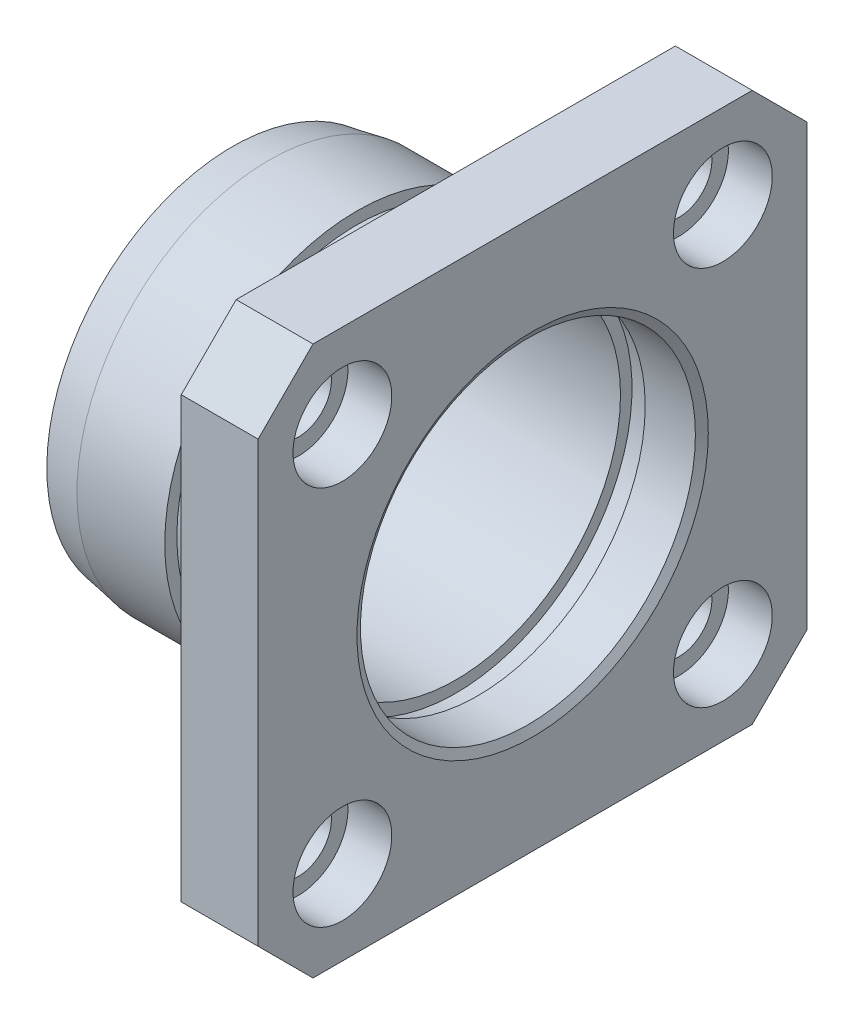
ISO-10303-21;
HEADER;
FILE_DESCRIPTION(('STEP AP214'),'2;1');
FILE_NAME('part.step','',(''),(''),'','','');
FILE_SCHEMA(('AUTOMOTIVE_DESIGN { 1 0 10303 214 1 1 1 1 }'));
ENDSEC;
DATA;
#1=APPLICATION_CONTEXT('core data for automotive mechanical design processes');
#2=APPLICATION_PROTOCOL_DEFINITION('international standard','automotive_design',2000,#1);
#3=PRODUCT_CONTEXT('',#1,'mechanical');
#4=PRODUCT('Part','Part','',(#3));
#5=PRODUCT_RELATED_PRODUCT_CATEGORY('part','',(#4));
#6=PRODUCT_DEFINITION_FORMATION('','',#4);
#7=PRODUCT_DEFINITION_CONTEXT('part definition',#1,'design');
#8=PRODUCT_DEFINITION('design','',#6,#7);
#9=PRODUCT_DEFINITION_SHAPE('','',#8);
#10=(LENGTH_UNIT() NAMED_UNIT(*) SI_UNIT(.MILLI.,.METRE.));
#11=(NAMED_UNIT(*) PLANE_ANGLE_UNIT() SI_UNIT($,.RADIAN.));
#12=(NAMED_UNIT(*) SI_UNIT($,.STERADIAN.) SOLID_ANGLE_UNIT());
#13=UNCERTAINTY_MEASURE_WITH_UNIT(LENGTH_MEASURE(1.E-05),#10,'distance_accuracy_value','');
#14=(GEOMETRIC_REPRESENTATION_CONTEXT(3) GLOBAL_UNCERTAINTY_ASSIGNED_CONTEXT((#13)) GLOBAL_UNIT_ASSIGNED_CONTEXT((#10,
#11,#12)) REPRESENTATION_CONTEXT('',''));
#15=CARTESIAN_POINT('',(0.,0.,0.));
#16=DIRECTION('',(0.,0.,1.));
#17=DIRECTION('',(1.,0.,0.));
#18=AXIS2_PLACEMENT_3D('',#15,#16,#17);
#19=CARTESIAN_POINT('',(56.,25.07,-32.));
#20=DIRECTION('',(1.,0.,0.));
#21=DIRECTION('',(0.,0.,-1.));
#22=AXIS2_PLACEMENT_3D('',#19,#20,#21);
#23=CYLINDRICAL_SURFACE('',#22,15.25);
#24=CARTESIAN_POINT('',(44.,25.07,-32.));
#25=DIRECTION('',(1.,0.,0.));
#26=DIRECTION('',(0.,0.,-1.));
#27=AXIS2_PLACEMENT_3D('',#24,#25,#26);
#28=CIRCLE('',#27,15.25);
#29=CARTESIAN_POINT('',(44.,25.07,-47.25));
#30=VERTEX_POINT('',#29);
#31=EDGE_CURVE('E186',#30,#30,#28,.T.);
#32=ORIENTED_EDGE('',*,*,#31,.F.);
#33=EDGE_LOOP('',(#32));
#34=FACE_BOUND('',#33,.T.);
#35=CARTESIAN_POINT('',(48.57,25.07,-32.));
#36=DIRECTION('',(1.,0.,0.));
#37=DIRECTION('',(0.,-0.707106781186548,-0.707106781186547));
#38=AXIS2_PLACEMENT_3D('',#35,#36,#37);
#39=CIRCLE('',#38,15.25);
#40=CARTESIAN_POINT('',(48.57,14.2866215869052,-42.7833784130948));
#41=VERTEX_POINT('',#40);
#42=EDGE_CURVE('E250',#41,#41,#39,.T.);
#43=ORIENTED_EDGE('',*,*,#42,.T.);
#44=EDGE_LOOP('',(#43));
#45=FACE_BOUND('',#44,.T.);
#46=ADVANCED_FACE('F17',(#34,#45),#23,.F.);
#47=CARTESIAN_POINT('',(45.,42.3941161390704,-14.6758838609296));
#48=DIRECTION('',(-1.,0.,0.));
#49=DIRECTION('',(0.,0.,1.));
#50=AXIS2_PLACEMENT_3D('',#47,#48,#49);
#51=CYLINDRICAL_SURFACE('',#50,4.5);
#52=CARTESIAN_POINT('',(45.,42.3941161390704,-14.6758838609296));
#53=DIRECTION('',(-1.,0.,0.));
#54=DIRECTION('',(0.,0.,1.));
#55=AXIS2_PLACEMENT_3D('',#52,#53,#54);
#56=CIRCLE('',#55,4.5);
#57=CARTESIAN_POINT('',(45.,42.3941161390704,-10.1758838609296));
#58=VERTEX_POINT('',#57);
#59=EDGE_CURVE('E21',#58,#58,#56,.T.);
#60=ORIENTED_EDGE('',*,*,#59,.T.);
#61=EDGE_LOOP('',(#60));
#62=FACE_BOUND('',#61,.T.);
#63=CARTESIAN_POINT('',(49.,42.3941161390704,-14.6758838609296));
#64=DIRECTION('',(-1.,0.,0.));
#65=DIRECTION('',(0.,0.,1.));
#66=AXIS2_PLACEMENT_3D('',#63,#64,#65);
#67=CIRCLE('',#66,4.5);
#68=CARTESIAN_POINT('',(49.,42.3941161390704,-10.1758838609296));
#69=VERTEX_POINT('',#68);
#70=EDGE_CURVE('E237',#69,#69,#67,.T.);
#71=ORIENTED_EDGE('',*,*,#70,.F.);
#72=EDGE_LOOP('',(#71));
#73=FACE_BOUND('',#72,.T.);
#74=ADVANCED_FACE('F342',(#62,#73),#51,.F.);
#75=CARTESIAN_POINT('',(45.,7.74588386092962,-14.6758838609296));
#76=DIRECTION('',(-1.,0.,0.));
#77=DIRECTION('',(0.,0.,1.));
#78=AXIS2_PLACEMENT_3D('',#75,#76,#77);
#79=CYLINDRICAL_SURFACE('',#78,4.5);
#80=CARTESIAN_POINT('',(45.,7.74588386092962,-14.6758838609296));
#81=DIRECTION('',(-1.,0.,0.));
#82=DIRECTION('',(0.,0.,1.));
#83=AXIS2_PLACEMENT_3D('',#80,#81,#82);
#84=CIRCLE('',#83,4.5);
#85=CARTESIAN_POINT('',(45.,7.74588386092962,-10.1758838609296));
#86=VERTEX_POINT('',#85);
#87=EDGE_CURVE('E245',#86,#86,#84,.T.);
#88=ORIENTED_EDGE('',*,*,#87,.T.);
#89=EDGE_LOOP('',(#88));
#90=FACE_BOUND('',#89,.T.);
#91=CARTESIAN_POINT('',(49.,7.74588386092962,-14.6758838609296));
#92=DIRECTION('',(-1.,0.,0.));
#93=DIRECTION('',(0.,0.,1.));
#94=AXIS2_PLACEMENT_3D('',#91,#92,#93);
#95=CIRCLE('',#94,4.5);
#96=CARTESIAN_POINT('',(49.,7.74588386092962,-10.1758838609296));
#97=VERTEX_POINT('',#96);
#98=EDGE_CURVE('E234',#97,#97,#95,.T.);
#99=ORIENTED_EDGE('',*,*,#98,.F.);
#100=EDGE_LOOP('',(#99));
#101=FACE_BOUND('',#100,.T.);
#102=ADVANCED_FACE('F347',(#90,#101),#79,.F.);
#103=CARTESIAN_POINT('',(45.,7.74588386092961,-49.3241161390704));
#104=DIRECTION('',(-1.,0.,0.));
#105=DIRECTION('',(0.,0.,1.));
#106=AXIS2_PLACEMENT_3D('',#103,#104,#105);
#107=CYLINDRICAL_SURFACE('',#106,4.5);
#108=CARTESIAN_POINT('',(45.,7.74588386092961,-49.3241161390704));
#109=DIRECTION('',(-1.,0.,0.));
#110=DIRECTION('',(0.,0.,1.));
#111=AXIS2_PLACEMENT_3D('',#108,#109,#110);
#112=CIRCLE('',#111,4.5);
#113=CARTESIAN_POINT('',(45.,7.74588386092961,-44.8241161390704));
#114=VERTEX_POINT('',#113);
#115=EDGE_CURVE('E243',#114,#114,#112,.T.);
#116=ORIENTED_EDGE('',*,*,#115,.T.);
#117=EDGE_LOOP('',(#116));
#118=FACE_BOUND('',#117,.T.);
#119=CARTESIAN_POINT('',(49.,7.74588386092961,-49.3241161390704));
#120=DIRECTION('',(-1.,0.,0.));
#121=DIRECTION('',(0.,0.,1.));
#122=AXIS2_PLACEMENT_3D('',#119,#120,#121);
#123=CIRCLE('',#122,4.5);
#124=CARTESIAN_POINT('',(49.,7.74588386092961,-44.8241161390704));
#125=VERTEX_POINT('',#124);
#126=EDGE_CURVE('E231',#125,#125,#123,.T.);
#127=ORIENTED_EDGE('',*,*,#126,.F.);
#128=EDGE_LOOP('',(#127));
#129=FACE_BOUND('',#128,.T.);
#130=ADVANCED_FACE('F274',(#118,#129),#107,.F.);
#131=CARTESIAN_POINT('',(45.,42.3941161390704,-49.3241161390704));
#132=DIRECTION('',(-1.,0.,0.));
#133=DIRECTION('',(0.,0.,1.));
#134=AXIS2_PLACEMENT_3D('',#131,#132,#133);
#135=CYLINDRICAL_SURFACE('',#134,4.5);
#136=CARTESIAN_POINT('',(45.,42.3941161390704,-49.3241161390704));
#137=DIRECTION('',(-1.,0.,0.));
#138=DIRECTION('',(0.,0.,1.));
#139=AXIS2_PLACEMENT_3D('',#136,#137,#138);
#140=CIRCLE('',#139,4.5);
#141=CARTESIAN_POINT('',(45.,42.3941161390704,-44.8241161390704));
#142=VERTEX_POINT('',#141);
#143=EDGE_CURVE('E240',#142,#142,#140,.T.);
#144=ORIENTED_EDGE('',*,*,#143,.T.);
#145=EDGE_LOOP('',(#144));
#146=FACE_BOUND('',#145,.T.);
#147=CARTESIAN_POINT('',(49.,42.3941161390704,-49.3241161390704));
#148=DIRECTION('',(-1.,0.,0.));
#149=DIRECTION('',(0.,0.,1.));
#150=AXIS2_PLACEMENT_3D('',#147,#148,#149);
#151=CIRCLE('',#150,4.5);
#152=CARTESIAN_POINT('',(49.,42.3941161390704,-44.8241161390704));
#153=VERTEX_POINT('',#152);
#154=EDGE_CURVE('E228',#153,#153,#151,.T.);
#155=ORIENTED_EDGE('',*,*,#154,.F.);
#156=EDGE_LOOP('',(#155));
#157=FACE_BOUND('',#156,.T.);
#158=ADVANCED_FACE('F263',(#146,#157),#135,.F.);
#159=CARTESIAN_POINT('',(49.,25.07,-32.));
#160=DIRECTION('',(1.,0.,0.));
#161=DIRECTION('',(0.,0.,-1.));
#162=AXIS2_PLACEMENT_3D('',#159,#160,#161);
#163=CONICAL_SURFACE('',#162,15.9947818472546,1.04719755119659);
#164=CARTESIAN_POINT('',(49.,25.07,-32.));
#165=DIRECTION('',(1.,0.,0.));
#166=DIRECTION('',(0.,0.,-1.));
#167=AXIS2_PLACEMENT_3D('',#164,#165,#166);
#168=CIRCLE('',#167,15.9947818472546);
#169=CARTESIAN_POINT('',(49.,25.07,-47.9947818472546));
#170=VERTEX_POINT('',#169);
#171=EDGE_CURVE('E225',#170,#170,#168,.F.);
#172=ORIENTED_EDGE('',*,*,#171,.F.);
#173=EDGE_LOOP('',(#172));
#174=FACE_BOUND('',#173,.T.);
#175=ORIENTED_EDGE('',*,*,#42,.F.);
#176=EDGE_LOOP('',(#175));
#177=FACE_BOUND('',#176,.T.);
#178=ADVANCED_FACE('F260',(#174,#177),#163,.F.);
#179=CARTESIAN_POINT('',(45.,42.3941161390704,-14.6758838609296));
#180=DIRECTION('',(-1.,0.,0.));
#181=DIRECTION('',(0.,0.,1.));
#182=AXIS2_PLACEMENT_3D('',#179,#180,#181);
#183=PLANE('',#182);
#184=ORIENTED_EDGE('',*,*,#59,.F.);
#185=EDGE_LOOP('',(#184));
#186=FACE_BOUND('',#185,.T.);
#187=CARTESIAN_POINT('',(45.,42.3941161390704,-14.6758838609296));
#188=DIRECTION('',(-1.,0.,0.));
#189=DIRECTION('',(0.,0.,1.));
#190=AXIS2_PLACEMENT_3D('',#187,#188,#189);
#191=CIRCLE('',#190,3.);
#192=CARTESIAN_POINT('',(45.,42.3941161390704,-11.6758838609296));
#193=VERTEX_POINT('',#192);
#194=EDGE_CURVE('E222',#193,#193,#191,.T.);
#195=ORIENTED_EDGE('',*,*,#194,.T.);
#196=EDGE_LOOP('',(#195));
#197=FACE_BOUND('',#196,.T.);
#198=ADVANCED_FACE('F262',(#186,#197),#183,.F.);
#199=CARTESIAN_POINT('',(45.,7.74588386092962,-14.6758838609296));
#200=DIRECTION('',(-1.,0.,0.));
#201=DIRECTION('',(0.,0.,1.));
#202=AXIS2_PLACEMENT_3D('',#199,#200,#201);
#203=PLANE('',#202);
#204=ORIENTED_EDGE('',*,*,#87,.F.);
#205=EDGE_LOOP('',(#204));
#206=FACE_BOUND('',#205,.T.);
#207=CARTESIAN_POINT('',(45.,7.74588386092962,-14.6758838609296));
#208=DIRECTION('',(-1.,0.,0.));
#209=DIRECTION('',(0.,0.,1.));
#210=AXIS2_PLACEMENT_3D('',#207,#208,#209);
#211=CIRCLE('',#210,3.);
#212=CARTESIAN_POINT('',(45.,7.74588386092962,-11.6758838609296));
#213=VERTEX_POINT('',#212);
#214=EDGE_CURVE('E219',#213,#213,#211,.T.);
#215=ORIENTED_EDGE('',*,*,#214,.T.);
#216=EDGE_LOOP('',(#215));
#217=FACE_BOUND('',#216,.T.);
#218=ADVANCED_FACE('F271',(#206,#217),#203,.F.);
#219=CARTESIAN_POINT('',(45.,7.74588386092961,-49.3241161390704));
#220=DIRECTION('',(-1.,0.,0.));
#221=DIRECTION('',(0.,0.,1.));
#222=AXIS2_PLACEMENT_3D('',#219,#220,#221);
#223=PLANE('',#222);
#224=ORIENTED_EDGE('',*,*,#115,.F.);
#225=EDGE_LOOP('',(#224));
#226=FACE_BOUND('',#225,.T.);
#227=CARTESIAN_POINT('',(45.,7.74588386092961,-49.3241161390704));
#228=DIRECTION('',(-1.,0.,0.));
#229=DIRECTION('',(0.,0.,1.));
#230=AXIS2_PLACEMENT_3D('',#227,#228,#229);
#231=CIRCLE('',#230,3.);
#232=CARTESIAN_POINT('',(45.,7.74588386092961,-46.3241161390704));
#233=VERTEX_POINT('',#232);
#234=EDGE_CURVE('E216',#233,#233,#231,.T.);
#235=ORIENTED_EDGE('',*,*,#234,.T.);
#236=EDGE_LOOP('',(#235));
#237=FACE_BOUND('',#236,.T.);
#238=ADVANCED_FACE('F377',(#226,#237),#223,.F.);
#239=CARTESIAN_POINT('',(45.,42.3941161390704,-49.3241161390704));
#240=DIRECTION('',(-1.,0.,0.));
#241=DIRECTION('',(0.,0.,1.));
#242=AXIS2_PLACEMENT_3D('',#239,#240,#241);
#243=PLANE('',#242);
#244=ORIENTED_EDGE('',*,*,#143,.F.);
#245=EDGE_LOOP('',(#244));
#246=FACE_BOUND('',#245,.T.);
#247=CARTESIAN_POINT('',(45.,42.3941161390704,-49.3241161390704));
#248=DIRECTION('',(-1.,0.,0.));
#249=DIRECTION('',(0.,0.,1.));
#250=AXIS2_PLACEMENT_3D('',#247,#248,#249);
#251=CIRCLE('',#250,3.);
#252=CARTESIAN_POINT('',(45.,42.3941161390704,-46.3241161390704));
#253=VERTEX_POINT('',#252);
#254=EDGE_CURVE('E100',#253,#253,#251,.T.);
#255=ORIENTED_EDGE('',*,*,#254,.T.);
#256=EDGE_LOOP('',(#255));
#257=FACE_BOUND('',#256,.T.);
#258=ADVANCED_FACE('F363',(#246,#257),#243,.F.);
#259=CARTESIAN_POINT('',(49.,53.3542712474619,-60.2842712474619));
#260=DIRECTION('',(1.,0.,0.));
#261=DIRECTION('',(0.,0.,-1.));
#262=AXIS2_PLACEMENT_3D('',#259,#260,#261);
#263=PLANE('',#262);
#264=DIRECTION('',(0.,1.,0.));
#265=VECTOR('',#264,1.);
#266=CARTESIAN_POINT('',(49.,50.07,-7.));
#267=LINE('',#266,#265);
#268=CARTESIAN_POINT('',(49.,5.07000000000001,-6.99999999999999));
#269=VERTEX_POINT('',#268);
#270=CARTESIAN_POINT('',(49.,45.07,-6.99999999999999));
#271=VERTEX_POINT('',#270);
#272=EDGE_CURVE('E123',#269,#271,#267,.T.);
#273=ORIENTED_EDGE('',*,*,#272,.F.);
#274=DIRECTION('',(0.,0.707106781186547,0.707106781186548));
#275=VECTOR('',#274,1.);
#276=CARTESIAN_POINT('',(49.,5.06999999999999,-7.00000000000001));
#277=LINE('',#276,#275);
#278=CARTESIAN_POINT('',(49.,0.0700000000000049,-12.));
#279=VERTEX_POINT('',#278);
#280=EDGE_CURVE('E118',#269,#279,#277,.F.);
#281=ORIENTED_EDGE('',*,*,#280,.T.);
#282=DIRECTION('',(0.,0.,-1.));
#283=VECTOR('',#282,1.);
#284=CARTESIAN_POINT('',(49.,0.0700000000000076,-7.00000000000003));
#285=LINE('',#284,#283);
#286=CARTESIAN_POINT('',(49.,0.0700000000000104,-52.));
#287=VERTEX_POINT('',#286);
#288=EDGE_CURVE('E114',#287,#279,#285,.F.);
#289=ORIENTED_EDGE('',*,*,#288,.F.);
#290=DIRECTION('',(0.,-0.707106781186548,0.707106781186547));
#291=VECTOR('',#290,1.);
#292=CARTESIAN_POINT('',(49.,0.0700000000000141,-52.));
#293=LINE('',#292,#291);
#294=CARTESIAN_POINT('',(49.,5.07,-57.));
#295=VERTEX_POINT('',#294);
#296=EDGE_CURVE('E99',#287,#295,#293,.F.);
#297=ORIENTED_EDGE('',*,*,#296,.T.);
#298=DIRECTION('',(0.,1.,0.));
#299=VECTOR('',#298,1.);
#300=CARTESIAN_POINT('',(49.,0.0699999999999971,-57.));
#301=LINE('',#300,#299);
#302=CARTESIAN_POINT('',(49.,45.07,-57.));
#303=VERTEX_POINT('',#302);
#304=EDGE_CURVE('E90',#303,#295,#301,.F.);
#305=ORIENTED_EDGE('',*,*,#304,.F.);
#306=DIRECTION('',(0.,-0.707106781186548,-0.707106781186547));
#307=VECTOR('',#306,1.);
#308=CARTESIAN_POINT('',(49.,45.07,-57.));
#309=LINE('',#308,#307);
#310=CARTESIAN_POINT('',(49.,50.07,-52.));
#311=VERTEX_POINT('',#310);
#312=EDGE_CURVE('E141',#303,#311,#309,.F.);
#313=ORIENTED_EDGE('',*,*,#312,.T.);
#314=DIRECTION('',(0.,0.,1.));
#315=VECTOR('',#314,1.);
#316=CARTESIAN_POINT('',(49.,50.07,-57.));
#317=LINE('',#316,#315);
#318=CARTESIAN_POINT('',(49.,50.07,-12.));
#319=VERTEX_POINT('',#318);
#320=EDGE_CURVE('E67',#319,#311,#317,.F.);
#321=ORIENTED_EDGE('',*,*,#320,.F.);
#322=DIRECTION('',(0.,0.707106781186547,-0.707106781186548));
#323=VECTOR('',#322,1.);
#324=CARTESIAN_POINT('',(49.,50.07,-12.));
#325=LINE('',#324,#323);
#326=EDGE_CURVE('E128',#319,#271,#325,.F.);
#327=ORIENTED_EDGE('',*,*,#326,.T.);
#328=EDGE_LOOP('',(#273,#281,#289,#297,#305,#313,#321,#327));
#329=FACE_BOUND('',#328,.T.);
#330=ORIENTED_EDGE('',*,*,#171,.T.);
#331=EDGE_LOOP('',(#330));
#332=FACE_BOUND('',#331,.T.);
#333=ORIENTED_EDGE('',*,*,#154,.T.);
#334=EDGE_LOOP('',(#333));
#335=FACE_BOUND('',#334,.T.);
#336=ORIENTED_EDGE('',*,*,#126,.T.);
#337=EDGE_LOOP('',(#336));
#338=FACE_BOUND('',#337,.T.);
#339=ORIENTED_EDGE('',*,*,#98,.T.);
#340=EDGE_LOOP('',(#339));
#341=FACE_BOUND('',#340,.T.);
#342=ORIENTED_EDGE('',*,*,#70,.T.);
#343=EDGE_LOOP('',(#342));
#344=FACE_BOUND('',#343,.T.);
#345=ADVANCED_FACE('F111',(#329,#332,#335,#338,#341,#344),#263,.T.);
#346=CARTESIAN_POINT('',(42.0000000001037,42.3941161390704,-14.6758838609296));
#347=DIRECTION('',(-1.,0.,0.));
#348=DIRECTION('',(0.,0.,1.));
#349=AXIS2_PLACEMENT_3D('',#346,#347,#348);
#350=CYLINDRICAL_SURFACE('',#349,3.);
#351=CARTESIAN_POINT('',(42.0000000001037,42.3941161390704,-14.6758838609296));
#352=DIRECTION('',(-1.,0.,0.));
#353=DIRECTION('',(0.,0.,1.));
#354=AXIS2_PLACEMENT_3D('',#351,#352,#353);
#355=CIRCLE('',#354,3.);
#356=CARTESIAN_POINT('',(42.0000000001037,42.3941161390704,-11.6758838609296));
#357=VERTEX_POINT('',#356);
#358=EDGE_CURVE('E140',#357,#357,#355,.F.);
#359=ORIENTED_EDGE('',*,*,#358,.F.);
#360=EDGE_LOOP('',(#359));
#361=FACE_BOUND('',#360,.T.);
#362=ORIENTED_EDGE('',*,*,#194,.F.);
#363=EDGE_LOOP('',(#362));
#364=FACE_BOUND('',#363,.T.);
#365=ADVANCED_FACE('F362',(#361,#364),#350,.F.);
#366=CARTESIAN_POINT('',(42.0000000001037,7.74588386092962,-14.6758838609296));
#367=DIRECTION('',(-1.,0.,0.));
#368=DIRECTION('',(0.,0.,1.));
#369=AXIS2_PLACEMENT_3D('',#366,#367,#368);
#370=CYLINDRICAL_SURFACE('',#369,3.);
#371=CARTESIAN_POINT('',(42.0000000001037,7.74588386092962,-14.6758838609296));
#372=DIRECTION('',(-1.,0.,0.));
#373=DIRECTION('',(0.,0.,1.));
#374=AXIS2_PLACEMENT_3D('',#371,#372,#373);
#375=CIRCLE('',#374,3.);
#376=CARTESIAN_POINT('',(42.0000000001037,7.74588386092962,-11.6758838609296));
#377=VERTEX_POINT('',#376);
#378=EDGE_CURVE('E209',#377,#377,#375,.F.);
#379=ORIENTED_EDGE('',*,*,#378,.F.);
#380=EDGE_LOOP('',(#379));
#381=FACE_BOUND('',#380,.T.);
#382=ORIENTED_EDGE('',*,*,#214,.F.);
#383=EDGE_LOOP('',(#382));
#384=FACE_BOUND('',#383,.T.);
#385=ADVANCED_FACE('F374',(#381,#384),#370,.F.);
#386=CARTESIAN_POINT('',(42.0000000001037,7.74588386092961,-49.3241161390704));
#387=DIRECTION('',(-1.,0.,0.));
#388=DIRECTION('',(0.,0.,1.));
#389=AXIS2_PLACEMENT_3D('',#386,#387,#388);
#390=CYLINDRICAL_SURFACE('',#389,3.);
#391=CARTESIAN_POINT('',(42.0000000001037,7.74588386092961,-49.3241161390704));
#392=DIRECTION('',(-1.,0.,0.));
#393=DIRECTION('',(0.,0.,1.));
#394=AXIS2_PLACEMENT_3D('',#391,#392,#393);
#395=CIRCLE('',#394,3.);
#396=CARTESIAN_POINT('',(42.0000000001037,7.74588386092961,-46.3241161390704));
#397=VERTEX_POINT('',#396);
#398=EDGE_CURVE('E206',#397,#397,#395,.F.);
#399=ORIENTED_EDGE('',*,*,#398,.F.);
#400=EDGE_LOOP('',(#399));
#401=FACE_BOUND('',#400,.T.);
#402=ORIENTED_EDGE('',*,*,#234,.F.);
#403=EDGE_LOOP('',(#402));
#404=FACE_BOUND('',#403,.T.);
#405=ADVANCED_FACE('F384',(#401,#404),#390,.F.);
#406=CARTESIAN_POINT('',(42.0000000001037,42.3941161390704,-49.3241161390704));
#407=DIRECTION('',(-1.,0.,0.));
#408=DIRECTION('',(0.,0.,1.));
#409=AXIS2_PLACEMENT_3D('',#406,#407,#408);
#410=CYLINDRICAL_SURFACE('',#409,3.);
#411=CARTESIAN_POINT('',(42.0000000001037,42.3941161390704,-49.3241161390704));
#412=DIRECTION('',(-1.,0.,0.));
#413=DIRECTION('',(0.,0.,1.));
#414=AXIS2_PLACEMENT_3D('',#411,#412,#413);
#415=CIRCLE('',#414,3.);
#416=CARTESIAN_POINT('',(42.0000000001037,42.3941161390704,-46.3241161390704));
#417=VERTEX_POINT('',#416);
#418=EDGE_CURVE('E159',#417,#417,#415,.F.);
#419=ORIENTED_EDGE('',*,*,#418,.F.);
#420=EDGE_LOOP('',(#419));
#421=FACE_BOUND('',#420,.T.);
#422=ORIENTED_EDGE('',*,*,#254,.F.);
#423=EDGE_LOOP('',(#422));
#424=FACE_BOUND('',#423,.T.);
#425=ADVANCED_FACE('F388',(#421,#424),#410,.F.);
#426=CARTESIAN_POINT('',(-84.1027300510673,0.0699999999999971,-57.));
#427=DIRECTION('',(0.,0.,-1.));
#428=DIRECTION('',(-1.,0.,0.));
#429=AXIS2_PLACEMENT_3D('',#426,#427,#428);
#430=PLANE('',#429);
#431=DIRECTION('',(0.,1.,0.));
#432=VECTOR('',#431,1.);
#433=CARTESIAN_POINT('',(42.,37.4443686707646,-57.));
#434=LINE('',#433,#432);
#435=CARTESIAN_POINT('',(42.,45.07,-57.));
#436=VERTEX_POINT('',#435);
#437=CARTESIAN_POINT('',(42.,5.07,-57.));
#438=VERTEX_POINT('',#437);
#439=EDGE_CURVE('E157',#436,#438,#434,.F.);
#440=ORIENTED_EDGE('',*,*,#439,.F.);
#441=DIRECTION('',(1.,0.,0.));
#442=VECTOR('',#441,1.);
#443=CARTESIAN_POINT('',(-84.1027300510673,45.07,-57.));
#444=LINE('',#443,#442);
#445=EDGE_CURVE('E61',#436,#303,#444,.T.);
#446=ORIENTED_EDGE('',*,*,#445,.T.);
#447=ORIENTED_EDGE('',*,*,#304,.T.);
#448=DIRECTION('',(1.,0.,0.));
#449=VECTOR('',#448,1.);
#450=CARTESIAN_POINT('',(-84.1027300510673,5.07,-57.));
#451=LINE('',#450,#449);
#452=EDGE_CURVE('E94',#295,#438,#451,.F.);
#453=ORIENTED_EDGE('',*,*,#452,.T.);
#454=EDGE_LOOP('',(#440,#446,#447,#453));
#455=FACE_BOUND('',#454,.T.);
#456=ADVANCED_FACE('F93',(#455),#430,.T.);
#457=CARTESIAN_POINT('',(-84.1027300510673,0.0699999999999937,-52.));
#458=DIRECTION('',(0.,0.707106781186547,0.707106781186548));
#459=DIRECTION('',(0.,-0.707106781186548,0.707106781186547));
#460=AXIS2_PLACEMENT_3D('',#457,#458,#459);
#461=PLANE('',#460);
#462=ORIENTED_EDGE('',*,*,#452,.F.);
#463=ORIENTED_EDGE('',*,*,#296,.F.);
#464=DIRECTION('',(1.,0.,0.));
#465=VECTOR('',#464,1.);
#466=CARTESIAN_POINT('',(-84.1027300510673,0.0699999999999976,-52.));
#467=LINE('',#466,#465);
#468=CARTESIAN_POINT('',(42.,0.0700000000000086,-52.));
#469=VERTEX_POINT('',#468);
#470=EDGE_CURVE('E107',#469,#287,#467,.T.);
#471=ORIENTED_EDGE('',*,*,#470,.F.);
#472=DIRECTION('',(0.,-0.707106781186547,0.707106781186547));
#473=VECTOR('',#472,1.);
#474=CARTESIAN_POINT('',(42.,5.07,-57.));
#475=LINE('',#474,#473);
#476=EDGE_CURVE('E106',#438,#469,#475,.T.);
#477=ORIENTED_EDGE('',*,*,#476,.F.);
#478=EDGE_LOOP('',(#462,#463,#471,#477));
#479=FACE_BOUND('',#478,.T.);
#480=ADVANCED_FACE('F103',(#479),#461,.F.);
#481=CARTESIAN_POINT('',(-84.1027300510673,0.0700000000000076,-7.00000000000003));
#482=DIRECTION('',(0.,-1.,0.));
#483=DIRECTION('',(0.,0.,-1.));
#484=AXIS2_PLACEMENT_3D('',#481,#482,#483);
#485=PLANE('',#484);
#486=ORIENTED_EDGE('',*,*,#288,.T.);
#487=DIRECTION('',(1.,0.,0.));
#488=VECTOR('',#487,1.);
#489=CARTESIAN_POINT('',(-84.1027300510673,0.0700000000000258,-12.));
#490=LINE('',#489,#488);
#491=CARTESIAN_POINT('',(42.,0.0700000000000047,-12.));
#492=VERTEX_POINT('',#491);
#493=EDGE_CURVE('E120',#279,#492,#490,.F.);
#494=ORIENTED_EDGE('',*,*,#493,.T.);
#495=DIRECTION('',(0.,0.,1.));
#496=VECTOR('',#495,1.);
#497=CARTESIAN_POINT('',(42.,0.0700000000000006,-44.3743686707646));
#498=LINE('',#497,#496);
#499=EDGE_CURVE('E154',#469,#492,#498,.T.);
#500=ORIENTED_EDGE('',*,*,#499,.F.);
#501=ORIENTED_EDGE('',*,*,#470,.T.);
#502=EDGE_LOOP('',(#486,#494,#500,#501));
#503=FACE_BOUND('',#502,.T.);
#504=ADVANCED_FACE('F397',(#503),#485,.T.);
#505=CARTESIAN_POINT('',(-84.1027300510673,5.07000000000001,-7.00000000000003));
#506=DIRECTION('',(0.,0.707106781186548,-0.707106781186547));
#507=DIRECTION('',(0.,0.707106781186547,0.707106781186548));
#508=AXIS2_PLACEMENT_3D('',#505,#506,#507);
#509=PLANE('',#508);
#510=ORIENTED_EDGE('',*,*,#493,.F.);
#511=ORIENTED_EDGE('',*,*,#280,.F.);
#512=DIRECTION('',(1.,0.,0.));
#513=VECTOR('',#512,1.);
#514=CARTESIAN_POINT('',(-84.1027300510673,5.07000000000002,-7.00000000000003));
#515=LINE('',#514,#513);
#516=CARTESIAN_POINT('',(42.,5.07000000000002,-6.99999999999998));
#517=VERTEX_POINT('',#516);
#518=EDGE_CURVE('E125',#517,#269,#515,.T.);
#519=ORIENTED_EDGE('',*,*,#518,.F.);
#520=DIRECTION('',(0.,0.707106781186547,0.707106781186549));
#521=VECTOR('',#520,1.);
#522=CARTESIAN_POINT('',(42.,0.0700000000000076,-12.));
#523=LINE('',#522,#521);
#524=EDGE_CURVE('E152',#492,#517,#523,.T.);
#525=ORIENTED_EDGE('',*,*,#524,.F.);
#526=EDGE_LOOP('',(#510,#511,#519,#525));
#527=FACE_BOUND('',#526,.T.);
#528=ADVANCED_FACE('F400',(#527),#509,.F.);
#529=CARTESIAN_POINT('',(-84.1027300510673,50.07,-7.00000000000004));
#530=DIRECTION('',(0.,0.,1.));
#531=DIRECTION('',(1.,0.,0.));
#532=AXIS2_PLACEMENT_3D('',#529,#530,#531);
#533=PLANE('',#532);
#534=DIRECTION('',(0.,1.,0.));
#535=VECTOR('',#534,1.);
#536=CARTESIAN_POINT('',(42.,37.4443686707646,-6.99999999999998));
#537=LINE('',#536,#535);
#538=CARTESIAN_POINT('',(42.,45.07,-6.99999999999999));
#539=VERTEX_POINT('',#538);
#540=EDGE_CURVE('E150',#517,#539,#537,.T.);
#541=ORIENTED_EDGE('',*,*,#540,.F.);
#542=ORIENTED_EDGE('',*,*,#518,.T.);
#543=ORIENTED_EDGE('',*,*,#272,.T.);
#544=DIRECTION('',(1.,0.,0.));
#545=VECTOR('',#544,1.);
#546=CARTESIAN_POINT('',(-84.1027300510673,45.07,-6.99999999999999));
#547=LINE('',#546,#545);
#548=EDGE_CURVE('E130',#271,#539,#547,.F.);
#549=ORIENTED_EDGE('',*,*,#548,.T.);
#550=EDGE_LOOP('',(#541,#542,#543,#549));
#551=FACE_BOUND('',#550,.T.);
#552=ADVANCED_FACE('F404',(#551),#533,.T.);
#553=CARTESIAN_POINT('',(-84.1027300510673,50.07,-12.));
#554=DIRECTION('',(0.,-0.707106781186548,-0.707106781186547));
#555=DIRECTION('',(0.,0.707106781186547,-0.707106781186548));
#556=AXIS2_PLACEMENT_3D('',#553,#554,#555);
#557=PLANE('',#556);
#558=ORIENTED_EDGE('',*,*,#548,.F.);
#559=ORIENTED_EDGE('',*,*,#326,.F.);
#560=DIRECTION('',(1.,0.,0.));
#561=VECTOR('',#560,1.);
#562=CARTESIAN_POINT('',(-84.1027300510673,50.07,-12.));
#563=LINE('',#562,#561);
#564=CARTESIAN_POINT('',(42.,50.07,-12.));
#565=VERTEX_POINT('',#564);
#566=EDGE_CURVE('E135',#565,#319,#563,.T.);
#567=ORIENTED_EDGE('',*,*,#566,.F.);
#568=DIRECTION('',(0.,0.707106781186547,-0.707106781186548));
#569=VECTOR('',#568,1.);
#570=CARTESIAN_POINT('',(42.,45.07,-6.99999999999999));
#571=LINE('',#570,#569);
#572=EDGE_CURVE('E148',#539,#565,#571,.T.);
#573=ORIENTED_EDGE('',*,*,#572,.F.);
#574=EDGE_LOOP('',(#558,#559,#567,#573));
#575=FACE_BOUND('',#574,.T.);
#576=ADVANCED_FACE('F408',(#575),#557,.F.);
#577=CARTESIAN_POINT('',(-84.1027300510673,50.07,-57.));
#578=DIRECTION('',(0.,1.,0.));
#579=DIRECTION('',(0.,0.,1.));
#580=AXIS2_PLACEMENT_3D('',#577,#578,#579);
#581=PLANE('',#580);
#582=DIRECTION('',(0.,0.,1.));
#583=VECTOR('',#582,1.);
#584=CARTESIAN_POINT('',(42.,50.07,-44.3743686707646));
#585=LINE('',#584,#583);
#586=CARTESIAN_POINT('',(42.,50.07,-52.));
#587=VERTEX_POINT('',#586);
#588=EDGE_CURVE('E36',#565,#587,#585,.F.);
#589=ORIENTED_EDGE('',*,*,#588,.F.);
#590=ORIENTED_EDGE('',*,*,#566,.T.);
#591=ORIENTED_EDGE('',*,*,#320,.T.);
#592=DIRECTION('',(1.,0.,0.));
#593=VECTOR('',#592,1.);
#594=CARTESIAN_POINT('',(-84.1027300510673,50.07,-52.));
#595=LINE('',#594,#593);
#596=EDGE_CURVE('E138',#311,#587,#595,.F.);
#597=ORIENTED_EDGE('',*,*,#596,.T.);
#598=EDGE_LOOP('',(#589,#590,#591,#597));
#599=FACE_BOUND('',#598,.T.);
#600=ADVANCED_FACE('F412',(#599),#581,.T.);
#601=CARTESIAN_POINT('',(-84.1027300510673,45.07,-57.));
#602=DIRECTION('',(0.,-0.707106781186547,0.707106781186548));
#603=DIRECTION('',(0.,-0.707106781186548,-0.707106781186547));
#604=AXIS2_PLACEMENT_3D('',#601,#602,#603);
#605=PLANE('',#604);
#606=ORIENTED_EDGE('',*,*,#596,.F.);
#607=ORIENTED_EDGE('',*,*,#312,.F.);
#608=ORIENTED_EDGE('',*,*,#445,.F.);
#609=DIRECTION('',(0.,-0.707106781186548,-0.707106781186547));
#610=VECTOR('',#609,1.);
#611=CARTESIAN_POINT('',(42.,50.07,-52.));
#612=LINE('',#611,#610);
#613=EDGE_CURVE('E144',#587,#436,#612,.T.);
#614=ORIENTED_EDGE('',*,*,#613,.F.);
#615=EDGE_LOOP('',(#606,#607,#608,#614));
#616=FACE_BOUND('',#615,.T.);
#617=ADVANCED_FACE('F416',(#616),#605,.F.);
#618=CARTESIAN_POINT('',(42.,37.4443686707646,-44.3743686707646));
#619=DIRECTION('',(-1.,0.,0.));
#620=DIRECTION('',(0.,0.,1.));
#621=AXIS2_PLACEMENT_3D('',#618,#619,#620);
#622=PLANE('',#621);
#623=ORIENTED_EDGE('',*,*,#588,.T.);
#624=ORIENTED_EDGE('',*,*,#613,.T.);
#625=ORIENTED_EDGE('',*,*,#439,.T.);
#626=ORIENTED_EDGE('',*,*,#476,.T.);
#627=ORIENTED_EDGE('',*,*,#499,.T.);
#628=ORIENTED_EDGE('',*,*,#524,.T.);
#629=ORIENTED_EDGE('',*,*,#540,.T.);
#630=ORIENTED_EDGE('',*,*,#572,.T.);
#631=EDGE_LOOP('',(#623,#624,#625,#626,#627,#628,#629,#630));
#632=FACE_BOUND('',#631,.T.);
#633=ORIENTED_EDGE('',*,*,#418,.T.);
#634=EDGE_LOOP('',(#633));
#635=FACE_BOUND('',#634,.T.);
#636=ORIENTED_EDGE('',*,*,#398,.T.);
#637=EDGE_LOOP('',(#636));
#638=FACE_BOUND('',#637,.T.);
#639=ORIENTED_EDGE('',*,*,#378,.T.);
#640=EDGE_LOOP('',(#639));
#641=FACE_BOUND('',#640,.T.);
#642=ORIENTED_EDGE('',*,*,#358,.T.);
#643=EDGE_LOOP('',(#642));
#644=FACE_BOUND('',#643,.T.);
#645=CARTESIAN_POINT('',(42.,25.07,-32.));
#646=DIRECTION('',(1.,0.,0.));
#647=DIRECTION('',(0.,0.,-1.));
#648=AXIS2_PLACEMENT_3D('',#645,#646,#647);
#649=CIRCLE('',#648,17.5);
#650=CARTESIAN_POINT('',(42.,25.07,-49.5));
#651=VERTEX_POINT('',#650);
#652=EDGE_CURVE('E146',#651,#651,#649,.F.);
#653=ORIENTED_EDGE('',*,*,#652,.F.);
#654=EDGE_LOOP('',(#653));
#655=FACE_BOUND('',#654,.T.);
#656=ADVANCED_FACE('F419',(#632,#635,#638,#641,#644,#655),#622,.T.);
#657=CARTESIAN_POINT('',(56.,25.07,-32.));
#658=DIRECTION('',(1.,0.,0.));
#659=DIRECTION('',(0.,0.,-1.));
#660=AXIS2_PLACEMENT_3D('',#657,#658,#659);
#661=CYLINDRICAL_SURFACE('',#660,17.5);
#662=CARTESIAN_POINT('',(34.9,25.07,-32.));
#663=DIRECTION('',(1.,0.,0.));
#664=DIRECTION('',(0.,0.,-1.));
#665=AXIS2_PLACEMENT_3D('',#662,#663,#664);
#666=CIRCLE('',#665,17.5);
#667=CARTESIAN_POINT('',(34.9,25.07,-49.5));
#668=VERTEX_POINT('',#667);
#669=EDGE_CURVE('E199',#668,#668,#666,.T.);
#670=ORIENTED_EDGE('',*,*,#669,.T.);
#671=EDGE_LOOP('',(#670));
#672=FACE_BOUND('',#671,.T.);
#673=ORIENTED_EDGE('',*,*,#652,.T.);
#674=EDGE_LOOP('',(#673));
#675=FACE_BOUND('',#674,.T.);
#676=ADVANCED_FACE('F422',(#672,#675),#661,.T.);
#677=CARTESIAN_POINT('',(34.9,36.6665512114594,-43.5965512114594));
#678=DIRECTION('',(1.,0.,0.));
#679=DIRECTION('',(0.,0.,-1.));
#680=AXIS2_PLACEMENT_3D('',#677,#678,#679);
#681=PLANE('',#680);
#682=CARTESIAN_POINT('',(34.9,25.07,-32.));
#683=DIRECTION('',(-1.,0.,0.));
#684=DIRECTION('',(0.,0.,1.));
#685=AXIS2_PLACEMENT_3D('',#682,#683,#684);
#686=CIRCLE('',#685,16.4);
#687=CARTESIAN_POINT('',(34.9,25.07,-15.6));
#688=VERTEX_POINT('',#687);
#689=EDGE_CURVE('E196',#688,#688,#686,.T.);
#690=ORIENTED_EDGE('',*,*,#689,.F.);
#691=EDGE_LOOP('',(#690));
#692=FACE_BOUND('',#691,.T.);
#693=ORIENTED_EDGE('',*,*,#669,.F.);
#694=EDGE_LOOP('',(#693));
#695=FACE_BOUND('',#694,.T.);
#696=ADVANCED_FACE('F425',(#692,#695),#681,.F.);
#697=CARTESIAN_POINT('',(56.,25.07,-32.));
#698=DIRECTION('',(-1.,0.,0.));
#699=DIRECTION('',(0.,0.,1.));
#700=AXIS2_PLACEMENT_3D('',#697,#698,#699);
#701=CYLINDRICAL_SURFACE('',#700,16.4);
#702=CARTESIAN_POINT('',(33.,25.07,-32.));
#703=DIRECTION('',(-1.,0.,0.));
#704=DIRECTION('',(0.,0.,1.));
#705=AXIS2_PLACEMENT_3D('',#702,#703,#704);
#706=CIRCLE('',#705,16.4);
#707=CARTESIAN_POINT('',(33.,25.07,-15.6));
#708=VERTEX_POINT('',#707);
#709=EDGE_CURVE('E193',#708,#708,#706,.F.);
#710=ORIENTED_EDGE('',*,*,#709,.T.);
#711=EDGE_LOOP('',(#710));
#712=FACE_BOUND('',#711,.T.);
#713=ORIENTED_EDGE('',*,*,#689,.T.);
#714=EDGE_LOOP('',(#713));
#715=FACE_BOUND('',#714,.T.);
#716=ADVANCED_FACE('F429',(#712,#715),#701,.T.);
#717=CARTESIAN_POINT('',(33.,37.4443686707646,-44.3743686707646));
#718=DIRECTION('',(-1.,0.,0.));
#719=DIRECTION('',(0.,0.,1.));
#720=AXIS2_PLACEMENT_3D('',#717,#718,#719);
#721=PLANE('',#720);
#722=CARTESIAN_POINT('',(33.,25.07,-32.));
#723=DIRECTION('',(1.,0.,0.));
#724=DIRECTION('',(0.,0.,-1.));
#725=AXIS2_PLACEMENT_3D('',#722,#723,#724);
#726=CIRCLE('',#725,17.5);
#727=CARTESIAN_POINT('',(33.,25.07,-49.5));
#728=VERTEX_POINT('',#727);
#729=EDGE_CURVE('E164',#728,#728,#726,.F.);
#730=ORIENTED_EDGE('',*,*,#729,.F.);
#731=EDGE_LOOP('',(#730));
#732=FACE_BOUND('',#731,.T.);
#733=ORIENTED_EDGE('',*,*,#709,.F.);
#734=EDGE_LOOP('',(#733));
#735=FACE_BOUND('',#734,.T.);
#736=ADVANCED_FACE('F323',(#732,#735),#721,.F.);
#737=CARTESIAN_POINT('',(56.,25.07,-32.));
#738=DIRECTION('',(1.,0.,0.));
#739=DIRECTION('',(0.,0.,-1.));
#740=AXIS2_PLACEMENT_3D('',#737,#738,#739);
#741=CYLINDRICAL_SURFACE('',#740,17.5);
#742=CARTESIAN_POINT('',(25.,25.07,-32.));
#743=DIRECTION('',(1.,0.,0.));
#744=DIRECTION('',(0.,-0.707106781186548,-0.707106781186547));
#745=AXIS2_PLACEMENT_3D('',#742,#743,#744);
#746=CIRCLE('',#745,17.5);
#747=CARTESIAN_POINT('',(25.,12.6956313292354,-44.3743686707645));
#748=VERTEX_POINT('',#747);
#749=EDGE_CURVE('E160',#748,#748,#746,.F.);
#750=ORIENTED_EDGE('',*,*,#749,.F.);
#751=EDGE_LOOP('',(#750));
#752=FACE_BOUND('',#751,.T.);
#753=ORIENTED_EDGE('',*,*,#729,.T.);
#754=EDGE_LOOP('',(#753));
#755=FACE_BOUND('',#754,.T.);
#756=ADVANCED_FACE('F317',(#752,#755),#741,.T.);
#757=CARTESIAN_POINT('',(25.,25.07,-32.));
#758=DIRECTION('',(1.,0.,0.));
#759=DIRECTION('',(0.,0.,-1.));
#760=AXIS2_PLACEMENT_3D('',#757,#758,#759);
#761=CONICAL_SURFACE('',#760,17.5,0.174532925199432);
#762=ORIENTED_EDGE('',*,*,#749,.T.);
#763=EDGE_LOOP('',(#762));
#764=FACE_BOUND('',#763,.T.);
#765=CARTESIAN_POINT('',(21.6717130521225,25.07,-32.));
#766=DIRECTION('',(1.,0.,0.));
#767=DIRECTION('',(0.,-0.707106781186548,-0.707106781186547));
#768=AXIS2_PLACEMENT_3D('',#765,#766,#767);
#769=CIRCLE('',#768,16.9131332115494);
#770=CARTESIAN_POINT('',(21.6717130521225,13.110608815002,-43.959391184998));
#771=VERTEX_POINT('',#770);
#772=EDGE_CURVE('E163',#771,#771,#769,.F.);
#773=ORIENTED_EDGE('',*,*,#772,.F.);
#774=EDGE_LOOP('',(#773));
#775=FACE_BOUND('',#774,.T.);
#776=ADVANCED_FACE('F312',(#764,#775),#761,.T.);
#777=CARTESIAN_POINT('',(21.6717130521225,25.07,-32.));
#778=DIRECTION('',(1.,0.,0.));
#779=DIRECTION('',(0.,0.,-1.));
#780=AXIS2_PLACEMENT_3D('',#777,#778,#779);
#781=CONICAL_SURFACE('',#780,16.9131332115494,1.0471975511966);
#782=CARTESIAN_POINT('',(21.,25.07,-32.));
#783=DIRECTION('',(1.,0.,0.));
#784=DIRECTION('',(0.,0.,-1.));
#785=AXIS2_PLACEMENT_3D('',#782,#783,#784);
#786=CIRCLE('',#785,15.7496920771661);
#787=CARTESIAN_POINT('',(21.,25.07,-47.7496920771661));
#788=VERTEX_POINT('',#787);
#789=EDGE_CURVE('E169',#788,#788,#786,.F.);
#790=ORIENTED_EDGE('',*,*,#789,.F.);
#791=EDGE_LOOP('',(#790));
#792=FACE_BOUND('',#791,.T.);
#793=ORIENTED_EDGE('',*,*,#772,.T.);
#794=EDGE_LOOP('',(#793));
#795=FACE_BOUND('',#794,.T.);
#796=ADVANCED_FACE('F306',(#792,#795),#781,.T.);
#797=CARTESIAN_POINT('',(21.,33.9088347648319,-40.8388347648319));
#798=DIRECTION('',(-1.,0.,0.));
#799=DIRECTION('',(0.,0.,1.));
#800=AXIS2_PLACEMENT_3D('',#797,#798,#799);
#801=PLANE('',#800);
#802=CARTESIAN_POINT('',(21.,25.07,-32.));
#803=DIRECTION('',(1.,0.,0.));
#804=DIRECTION('',(0.,0.,-1.));
#805=AXIS2_PLACEMENT_3D('',#802,#803,#804);
#806=CIRCLE('',#805,12.5);
#807=CARTESIAN_POINT('',(21.,25.07,-44.5));
#808=VERTEX_POINT('',#807);
#809=EDGE_CURVE('E183',#808,#808,#806,.T.);
#810=ORIENTED_EDGE('',*,*,#809,.T.);
#811=EDGE_LOOP('',(#810));
#812=FACE_BOUND('',#811,.T.);
#813=ORIENTED_EDGE('',*,*,#789,.T.);
#814=EDGE_LOOP('',(#813));
#815=FACE_BOUND('',#814,.T.);
#816=ADVANCED_FACE('F303',(#812,#815),#801,.T.);
#817=CARTESIAN_POINT('',(44.,36.4190638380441,-43.3490638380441));
#818=DIRECTION('',(-1.,0.,0.));
#819=DIRECTION('',(0.,0.,1.));
#820=AXIS2_PLACEMENT_3D('',#817,#818,#819);
#821=PLANE('',#820);
#822=CARTESIAN_POINT('',(44.,25.07,-32.));
#823=DIRECTION('',(-1.,0.,0.));
#824=DIRECTION('',(0.,0.,1.));
#825=AXIS2_PLACEMENT_3D('',#822,#823,#824);
#826=CIRCLE('',#825,16.05);
#827=CARTESIAN_POINT('',(44.,25.07,-15.95));
#828=VERTEX_POINT('',#827);
#829=EDGE_CURVE('E180',#828,#828,#826,.T.);
#830=ORIENTED_EDGE('',*,*,#829,.T.);
#831=EDGE_LOOP('',(#830));
#832=FACE_BOUND('',#831,.T.);
#833=ORIENTED_EDGE('',*,*,#31,.T.);
#834=EDGE_LOOP('',(#833));
#835=FACE_BOUND('',#834,.T.);
#836=ADVANCED_FACE('F299',(#832,#835),#821,.T.);
#837=CARTESIAN_POINT('',(56.,25.07,-32.));
#838=DIRECTION('',(1.,0.,0.));
#839=DIRECTION('',(0.,0.,-1.));
#840=AXIS2_PLACEMENT_3D('',#837,#838,#839);
#841=CYLINDRICAL_SURFACE('',#840,12.5);
#842=CARTESIAN_POINT('',(23.,25.07,-32.));
#843=DIRECTION('',(1.,0.,0.));
#844=DIRECTION('',(0.,0.,-1.));
#845=AXIS2_PLACEMENT_3D('',#842,#843,#844);
#846=CIRCLE('',#845,12.5);
#847=CARTESIAN_POINT('',(23.,25.07,-44.5));
#848=VERTEX_POINT('',#847);
#849=EDGE_CURVE('E177',#848,#848,#846,.F.);
#850=ORIENTED_EDGE('',*,*,#849,.F.);
#851=EDGE_LOOP('',(#850));
#852=FACE_BOUND('',#851,.T.);
#853=ORIENTED_EDGE('',*,*,#809,.F.);
#854=EDGE_LOOP('',(#853));
#855=FACE_BOUND('',#854,.T.);
#856=ADVANCED_FACE('F296',(#852,#855),#841,.F.);
#857=CARTESIAN_POINT('',(56.,25.07,-32.));
#858=DIRECTION('',(-1.,0.,0.));
#859=DIRECTION('',(0.,0.,1.));
#860=AXIS2_PLACEMENT_3D('',#857,#858,#859);
#861=CYLINDRICAL_SURFACE('',#860,16.05);
#862=CARTESIAN_POINT('',(42.,25.07,-32.));
#863=DIRECTION('',(-1.,0.,0.));
#864=DIRECTION('',(0.,0.,1.));
#865=AXIS2_PLACEMENT_3D('',#862,#863,#864);
#866=CIRCLE('',#865,16.05);
#867=CARTESIAN_POINT('',(42.,25.07,-15.95));
#868=VERTEX_POINT('',#867);
#869=EDGE_CURVE('E174',#868,#868,#866,.F.);
#870=ORIENTED_EDGE('',*,*,#869,.F.);
#871=EDGE_LOOP('',(#870));
#872=FACE_BOUND('',#871,.T.);
#873=ORIENTED_EDGE('',*,*,#829,.F.);
#874=EDGE_LOOP('',(#873));
#875=FACE_BOUND('',#874,.T.);
#876=ADVANCED_FACE('F292',(#872,#875),#861,.F.);
#877=CARTESIAN_POINT('',(23.,35.6766017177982,-42.6066017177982));
#878=DIRECTION('',(1.,0.,0.));
#879=DIRECTION('',(0.,0.,-1.));
#880=AXIS2_PLACEMENT_3D('',#877,#878,#879);
#881=PLANE('',#880);
#882=CARTESIAN_POINT('',(23.,25.07,-32.));
#883=DIRECTION('',(1.,0.,0.));
#884=DIRECTION('',(0.,0.,-1.));
#885=AXIS2_PLACEMENT_3D('',#882,#883,#884);
#886=CIRCLE('',#885,15.);
#887=CARTESIAN_POINT('',(23.,25.07,-47.));
#888=VERTEX_POINT('',#887);
#889=EDGE_CURVE('E27',#888,#888,#886,.T.);
#890=ORIENTED_EDGE('',*,*,#889,.T.);
#891=EDGE_LOOP('',(#890));
#892=FACE_BOUND('',#891,.T.);
#893=ORIENTED_EDGE('',*,*,#849,.T.);
#894=EDGE_LOOP('',(#893));
#895=FACE_BOUND('',#894,.T.);
#896=ADVANCED_FACE('F284',(#892,#895),#881,.T.);
#897=CARTESIAN_POINT('',(42.,35.8533784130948,-42.7833784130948));
#898=DIRECTION('',(1.,0.,0.));
#899=DIRECTION('',(0.,0.,-1.));
#900=AXIS2_PLACEMENT_3D('',#897,#898,#899);
#901=PLANE('',#900);
#902=ORIENTED_EDGE('',*,*,#869,.T.);
#903=EDGE_LOOP('',(#902));
#904=FACE_BOUND('',#903,.T.);
#905=CARTESIAN_POINT('',(42.,25.07,-32.));
#906=DIRECTION('',(1.,0.,0.));
#907=DIRECTION('',(0.,0.,-1.));
#908=AXIS2_PLACEMENT_3D('',#905,#906,#907);
#909=CIRCLE('',#908,15.);
#910=CARTESIAN_POINT('',(42.,25.07,-47.));
#911=VERTEX_POINT('',#910);
#912=EDGE_CURVE('E11',#911,#911,#909,.F.);
#913=ORIENTED_EDGE('',*,*,#912,.T.);
#914=EDGE_LOOP('',(#913));
#915=FACE_BOUND('',#914,.T.);
#916=ADVANCED_FACE('F279',(#904,#915),#901,.T.);
#917=CARTESIAN_POINT('',(56.,25.07,-32.));
#918=DIRECTION('',(1.,0.,0.));
#919=DIRECTION('',(0.,0.,-1.));
#920=AXIS2_PLACEMENT_3D('',#917,#918,#919);
#921=CYLINDRICAL_SURFACE('',#920,15.);
#922=ORIENTED_EDGE('',*,*,#912,.F.);
#923=EDGE_LOOP('',(#922));
#924=FACE_BOUND('',#923,.T.);
#925=ORIENTED_EDGE('',*,*,#889,.F.);
#926=EDGE_LOOP('',(#925));
#927=FACE_BOUND('',#926,.T.);
#928=ADVANCED_FACE('F19',(#924,#927),#921,.F.);
#929=CLOSED_SHELL('',(#46,#74,#102,#130,#158,#178,#198,#218,#238,#258,#345,#365,#385,#405,#425,
#456,#480,#504,#528,#552,#576,#600,#617,#656,#676,#696,#716,#736,#756,#776,#796,#816,#836,#856,
#876,#896,#916,#928));
#930=MANIFOLD_SOLID_BREP('B1',#929);
#931=ADVANCED_BREP_SHAPE_REPRESENTATION('',(#18,#930),#14);
#932=SHAPE_DEFINITION_REPRESENTATION(#9,#931);
ENDSEC;
END-ISO-10303-21;
